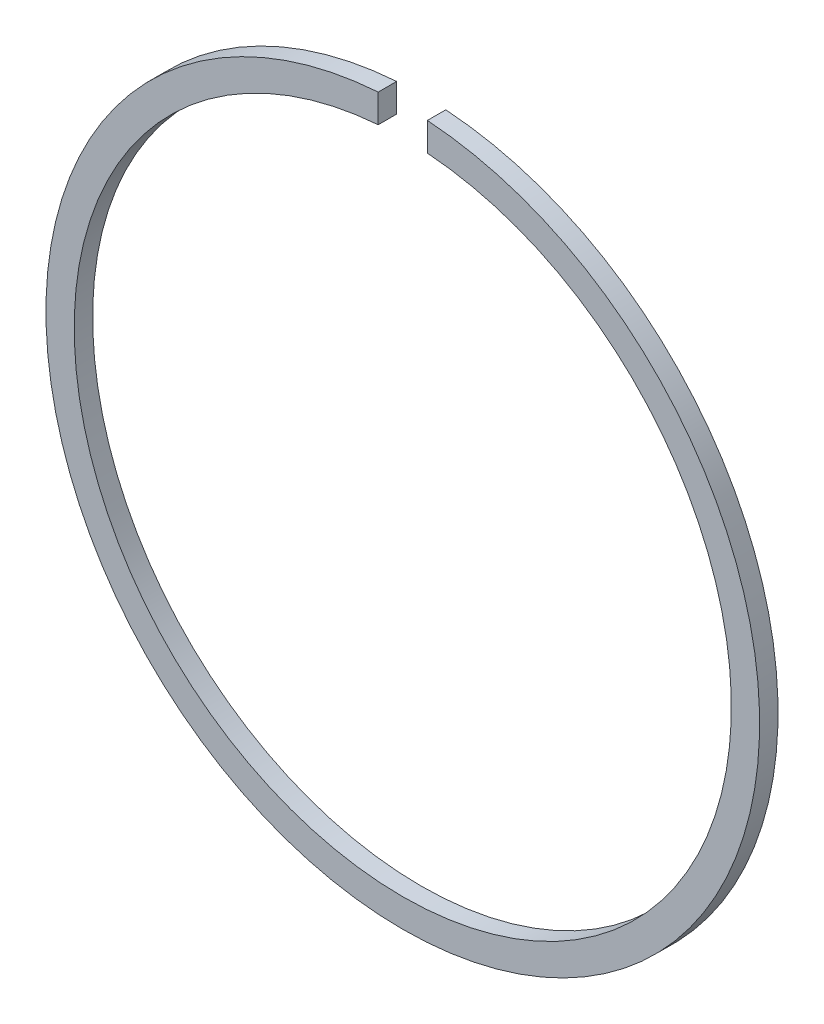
ISO-10303-21;
HEADER;
FILE_DESCRIPTION(('STEP AP214'),'2;1');
FILE_NAME('part.step','',(''),(''),'','','');
FILE_SCHEMA(('AUTOMOTIVE_DESIGN { 1 0 10303 214 1 1 1 1 }'));
ENDSEC;
DATA;
#1=APPLICATION_CONTEXT('core data for automotive mechanical design processes');
#2=APPLICATION_PROTOCOL_DEFINITION('international standard','automotive_design',2000,#1);
#3=PRODUCT_CONTEXT('',#1,'mechanical');
#4=PRODUCT('Part','Part','',(#3));
#5=PRODUCT_RELATED_PRODUCT_CATEGORY('part','',(#4));
#6=PRODUCT_DEFINITION_FORMATION('','',#4);
#7=PRODUCT_DEFINITION_CONTEXT('part definition',#1,'design');
#8=PRODUCT_DEFINITION('design','',#6,#7);
#9=PRODUCT_DEFINITION_SHAPE('','',#8);
#10=(LENGTH_UNIT() NAMED_UNIT(*) SI_UNIT(.MILLI.,.METRE.));
#11=(NAMED_UNIT(*) PLANE_ANGLE_UNIT() SI_UNIT($,.RADIAN.));
#12=(NAMED_UNIT(*) SI_UNIT($,.STERADIAN.) SOLID_ANGLE_UNIT());
#13=UNCERTAINTY_MEASURE_WITH_UNIT(LENGTH_MEASURE(1.E-05),#10,'distance_accuracy_value','');
#14=(GEOMETRIC_REPRESENTATION_CONTEXT(3) GLOBAL_UNCERTAINTY_ASSIGNED_CONTEXT((#13)) GLOBAL_UNIT_ASSIGNED_CONTEXT((#10,
#11,#12)) REPRESENTATION_CONTEXT('',''));
#15=CARTESIAN_POINT('',(0.,0.,0.));
#16=DIRECTION('',(0.,0.,1.));
#17=DIRECTION('',(1.,0.,0.));
#18=AXIS2_PLACEMENT_3D('',#15,#16,#17);
#19=CARTESIAN_POINT('',(0.,0.,0.75));
#20=DIRECTION('',(0.,0.,1.));
#21=DIRECTION('',(1.,0.,0.));
#22=AXIS2_PLACEMENT_3D('',#19,#20,#21);
#23=PLANE('',#22);
#24=DIRECTION('',(0.,1.,0.));
#25=VECTOR('',#24,1.);
#26=CARTESIAN_POINT('',(2.,26.6751288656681,0.75));
#27=LINE('',#26,#25);
#28=CARTESIAN_POINT('',(2.,26.6751288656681,0.75));
#29=VERTEX_POINT('',#28);
#30=CARTESIAN_POINT('',(2.,28.9810714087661,0.75));
#31=VERTEX_POINT('',#30);
#32=EDGE_CURVE('E82',#29,#31,#27,.T.);
#33=ORIENTED_EDGE('',*,*,#32,.F.);
#34=CARTESIAN_POINT('',(0.,0.,0.75));
#35=DIRECTION('',(0.,0.,1.));
#36=DIRECTION('',(1.,0.,0.));
#37=AXIS2_PLACEMENT_3D('',#34,#35,#36);
#38=CIRCLE('',#37,26.75);
#39=CARTESIAN_POINT('',(-2.,26.6751288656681,0.75));
#40=VERTEX_POINT('',#39);
#41=EDGE_CURVE('E90',#40,#29,#38,.T.);
#42=ORIENTED_EDGE('',*,*,#41,.F.);
#43=DIRECTION('',(0.,-1.,0.));
#44=VECTOR('',#43,1.);
#45=CARTESIAN_POINT('',(-2.,26.6751288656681,0.75));
#46=LINE('',#45,#44);
#47=CARTESIAN_POINT('',(-2.,28.9810714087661,0.75));
#48=VERTEX_POINT('',#47);
#49=EDGE_CURVE('E57',#48,#40,#46,.T.);
#50=ORIENTED_EDGE('',*,*,#49,.F.);
#51=CARTESIAN_POINT('',(0.,0.,0.75));
#52=DIRECTION('',(0.,0.,1.));
#53=DIRECTION('',(1.,0.,0.));
#54=AXIS2_PLACEMENT_3D('',#51,#52,#53);
#55=CIRCLE('',#54,29.05);
#56=EDGE_CURVE('E11',#48,#31,#55,.T.);
#57=ORIENTED_EDGE('',*,*,#56,.T.);
#58=EDGE_LOOP('',(#33,#42,#50,#57));
#59=FACE_BOUND('',#58,.T.);
#60=ADVANCED_FACE('F34',(#59),#23,.T.);
#61=CARTESIAN_POINT('',(0.,0.,-0.75));
#62=DIRECTION('',(0.,0.,1.));
#63=DIRECTION('',(1.,0.,0.));
#64=AXIS2_PLACEMENT_3D('',#61,#62,#63);
#65=PLANE('',#64);
#66=CARTESIAN_POINT('',(0.,0.,-0.75));
#67=DIRECTION('',(0.,0.,1.));
#68=DIRECTION('',(1.,0.,0.));
#69=AXIS2_PLACEMENT_3D('',#66,#67,#68);
#70=CIRCLE('',#69,26.75);
#71=CARTESIAN_POINT('',(-2.,26.6751288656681,-0.75));
#72=VERTEX_POINT('',#71);
#73=CARTESIAN_POINT('',(2.,26.6751288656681,-0.75));
#74=VERTEX_POINT('',#73);
#75=EDGE_CURVE('E92',#72,#74,#70,.T.);
#76=ORIENTED_EDGE('',*,*,#75,.T.);
#77=DIRECTION('',(0.,1.,0.));
#78=VECTOR('',#77,1.);
#79=CARTESIAN_POINT('',(2.,26.6751288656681,-0.75));
#80=LINE('',#79,#78);
#81=CARTESIAN_POINT('',(2.,28.9810714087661,-0.75));
#82=VERTEX_POINT('',#81);
#83=EDGE_CURVE('E49',#74,#82,#80,.T.);
#84=ORIENTED_EDGE('',*,*,#83,.T.);
#85=CARTESIAN_POINT('',(0.,0.,-0.75));
#86=DIRECTION('',(0.,0.,1.));
#87=DIRECTION('',(1.,0.,0.));
#88=AXIS2_PLACEMENT_3D('',#85,#86,#87);
#89=CIRCLE('',#88,29.05);
#90=CARTESIAN_POINT('',(-2.,28.9810714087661,-0.75));
#91=VERTEX_POINT('',#90);
#92=EDGE_CURVE('E38',#91,#82,#89,.T.);
#93=ORIENTED_EDGE('',*,*,#92,.F.);
#94=DIRECTION('',(0.,-1.,0.));
#95=VECTOR('',#94,1.);
#96=CARTESIAN_POINT('',(-2.,26.6751288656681,-0.75));
#97=LINE('',#96,#95);
#98=EDGE_CURVE('E73',#91,#72,#97,.T.);
#99=ORIENTED_EDGE('',*,*,#98,.T.);
#100=EDGE_LOOP('',(#76,#84,#93,#99));
#101=FACE_BOUND('',#100,.T.);
#102=ADVANCED_FACE('F89',(#101),#65,.F.);
#103=CARTESIAN_POINT('',(0.,0.,0.75));
#104=DIRECTION('',(0.,0.,-1.));
#105=DIRECTION('',(-1.,0.,0.));
#106=AXIS2_PLACEMENT_3D('',#103,#104,#105);
#107=CYLINDRICAL_SURFACE('',#106,29.05);
#108=ORIENTED_EDGE('',*,*,#92,.T.);
#109=DIRECTION('',(0.,0.,1.));
#110=VECTOR('',#109,1.);
#111=CARTESIAN_POINT('',(2.,28.9810714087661,-0.75));
#112=LINE('',#111,#110);
#113=EDGE_CURVE('E96',#82,#31,#112,.T.);
#114=ORIENTED_EDGE('',*,*,#113,.T.);
#115=ORIENTED_EDGE('',*,*,#56,.F.);
#116=DIRECTION('',(0.,0.,1.));
#117=VECTOR('',#116,1.);
#118=CARTESIAN_POINT('',(-2.,28.9810714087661,-0.75));
#119=LINE('',#118,#117);
#120=EDGE_CURVE('E76',#91,#48,#119,.T.);
#121=ORIENTED_EDGE('',*,*,#120,.F.);
#122=EDGE_LOOP('',(#108,#114,#115,#121));
#123=FACE_BOUND('',#122,.T.);
#124=ADVANCED_FACE('F36',(#123),#107,.T.);
#125=CARTESIAN_POINT('',(0.,0.,0.75));
#126=DIRECTION('',(0.,0.,-1.));
#127=DIRECTION('',(-1.,0.,0.));
#128=AXIS2_PLACEMENT_3D('',#125,#126,#127);
#129=CYLINDRICAL_SURFACE('',#128,26.75);
#130=DIRECTION('',(0.,0.,1.));
#131=VECTOR('',#130,1.);
#132=CARTESIAN_POINT('',(2.,26.6751288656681,-0.75));
#133=LINE('',#132,#131);
#134=EDGE_CURVE('E100',#74,#29,#133,.T.);
#135=ORIENTED_EDGE('',*,*,#134,.F.);
#136=ORIENTED_EDGE('',*,*,#75,.F.);
#137=DIRECTION('',(0.,0.,1.));
#138=VECTOR('',#137,1.);
#139=CARTESIAN_POINT('',(-2.,26.6751288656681,-0.75));
#140=LINE('',#139,#138);
#141=EDGE_CURVE('E77',#72,#40,#140,.T.);
#142=ORIENTED_EDGE('',*,*,#141,.T.);
#143=ORIENTED_EDGE('',*,*,#41,.T.);
#144=EDGE_LOOP('',(#135,#136,#142,#143));
#145=FACE_BOUND('',#144,.T.);
#146=ADVANCED_FACE('F114',(#145),#129,.F.);
#147=CARTESIAN_POINT('',(-2.,26.6751288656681,-0.75));
#148=DIRECTION('',(-1.,0.,0.));
#149=DIRECTION('',(0.,0.,1.));
#150=AXIS2_PLACEMENT_3D('',#147,#148,#149);
#151=PLANE('',#150);
#152=ORIENTED_EDGE('',*,*,#49,.T.);
#153=ORIENTED_EDGE('',*,*,#141,.F.);
#154=ORIENTED_EDGE('',*,*,#98,.F.);
#155=ORIENTED_EDGE('',*,*,#120,.T.);
#156=EDGE_LOOP('',(#152,#153,#154,#155));
#157=FACE_BOUND('',#156,.T.);
#158=ADVANCED_FACE('F75',(#157),#151,.F.);
#159=CARTESIAN_POINT('',(2.,26.6751288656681,-0.75));
#160=DIRECTION('',(1.,0.,0.));
#161=DIRECTION('',(0.,0.,-1.));
#162=AXIS2_PLACEMENT_3D('',#159,#160,#161);
#163=PLANE('',#162);
#164=ORIENTED_EDGE('',*,*,#32,.T.);
#165=ORIENTED_EDGE('',*,*,#113,.F.);
#166=ORIENTED_EDGE('',*,*,#83,.F.);
#167=ORIENTED_EDGE('',*,*,#134,.T.);
#168=EDGE_LOOP('',(#164,#165,#166,#167));
#169=FACE_BOUND('',#168,.T.);
#170=ADVANCED_FACE('F106',(#169),#163,.F.);
#171=CLOSED_SHELL('',(#60,#102,#124,#146,#158,#170));
#172=MANIFOLD_SOLID_BREP('B2',#171);
#173=ADVANCED_BREP_SHAPE_REPRESENTATION('',(#18,#172),#14);
#174=SHAPE_DEFINITION_REPRESENTATION(#9,#173);
ENDSEC;
END-ISO-10303-21;
